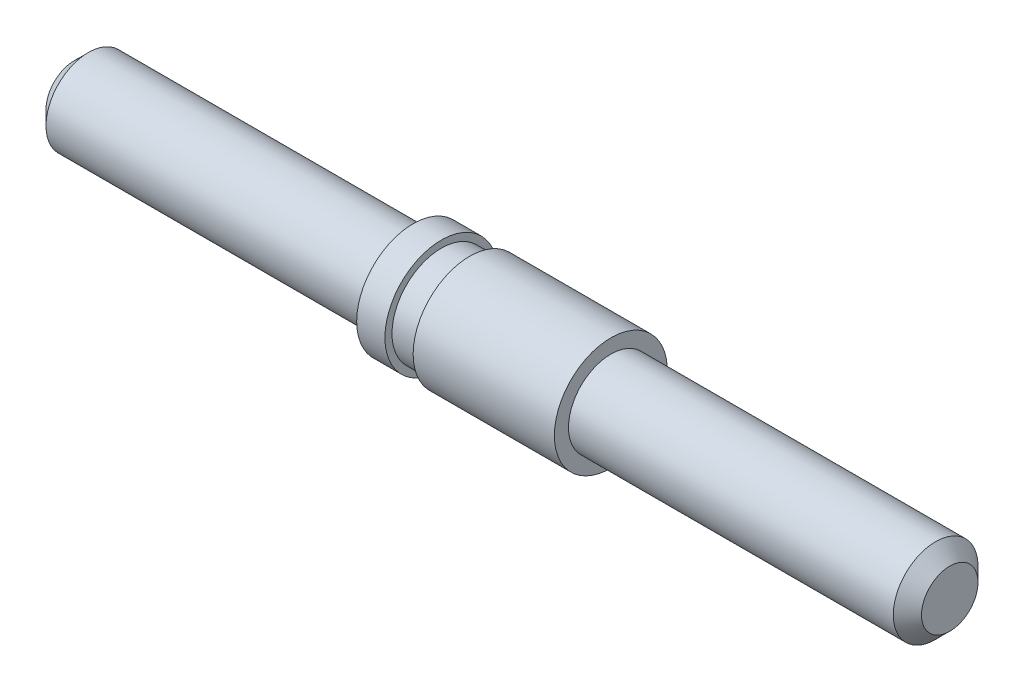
ISO-10303-21;
HEADER;
FILE_DESCRIPTION(('STEP AP214'),'2;1');
FILE_NAME('part.step','',(''),(''),'','','');
FILE_SCHEMA(('AUTOMOTIVE_DESIGN { 1 0 10303 214 1 1 1 1 }'));
ENDSEC;
DATA;
#1=APPLICATION_CONTEXT('core data for automotive mechanical design processes');
#2=APPLICATION_PROTOCOL_DEFINITION('international standard','automotive_design',2000,#1);
#3=PRODUCT_CONTEXT('',#1,'mechanical');
#4=PRODUCT('Part','Part','',(#3));
#5=PRODUCT_RELATED_PRODUCT_CATEGORY('part','',(#4));
#6=PRODUCT_DEFINITION_FORMATION('','',#4);
#7=PRODUCT_DEFINITION_CONTEXT('part definition',#1,'design');
#8=PRODUCT_DEFINITION('design','',#6,#7);
#9=PRODUCT_DEFINITION_SHAPE('','',#8);
#10=(LENGTH_UNIT() NAMED_UNIT(*) SI_UNIT(.MILLI.,.METRE.));
#11=(NAMED_UNIT(*) PLANE_ANGLE_UNIT() SI_UNIT($,.RADIAN.));
#12=(NAMED_UNIT(*) SI_UNIT($,.STERADIAN.) SOLID_ANGLE_UNIT());
#13=UNCERTAINTY_MEASURE_WITH_UNIT(LENGTH_MEASURE(1.E-05),#10,'distance_accuracy_value','');
#14=(GEOMETRIC_REPRESENTATION_CONTEXT(3) GLOBAL_UNCERTAINTY_ASSIGNED_CONTEXT((#13)) GLOBAL_UNIT_ASSIGNED_CONTEXT((#10,
#11,#12)) REPRESENTATION_CONTEXT('',''));
#15=CARTESIAN_POINT('',(0.,0.,0.));
#16=DIRECTION('',(0.,0.,1.));
#17=DIRECTION('',(1.,0.,0.));
#18=AXIS2_PLACEMENT_3D('',#15,#16,#17);
#19=CARTESIAN_POINT('',(25.5,20.,0.));
#20=DIRECTION('',(-1.,0.,0.));
#21=DIRECTION('',(0.,0.,1.));
#22=AXIS2_PLACEMENT_3D('',#19,#20,#21);
#23=CONICAL_SURFACE('',#22,1.49999999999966,0.785398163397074);
#24=CARTESIAN_POINT('',(26.,20.,0.));
#25=DIRECTION('',(-1.,0.,0.));
#26=DIRECTION('',(0.,0.,1.));
#27=AXIS2_PLACEMENT_3D('',#24,#25,#26);
#28=CIRCLE('',#27,1.00000000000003);
#29=CARTESIAN_POINT('',(26.,20.,1.00000000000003));
#30=VERTEX_POINT('',#29);
#31=EDGE_CURVE('E10',#30,#30,#28,.T.);
#32=ORIENTED_EDGE('',*,*,#31,.T.);
#33=EDGE_LOOP('',(#32));
#34=FACE_BOUND('',#33,.T.);
#35=CARTESIAN_POINT('',(25.5,20.,0.));
#36=DIRECTION('',(-1.,0.,0.));
#37=DIRECTION('',(0.,0.,1.));
#38=AXIS2_PLACEMENT_3D('',#35,#36,#37);
#39=CIRCLE('',#38,1.49999999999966);
#40=CARTESIAN_POINT('',(25.5,20.,1.49999999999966));
#41=VERTEX_POINT('',#40);
#42=EDGE_CURVE('E390',#41,#41,#39,.T.);
#43=ORIENTED_EDGE('',*,*,#42,.F.);
#44=EDGE_LOOP('',(#43));
#45=FACE_BOUND('',#44,.T.);
#46=ADVANCED_FACE('F350',(#34,#45),#23,.T.);
#47=CARTESIAN_POINT('',(26.,21.,0.));
#48=DIRECTION('',(1.,0.,0.));
#49=DIRECTION('',(0.,0.,-1.));
#50=AXIS2_PLACEMENT_3D('',#47,#48,#49);
#51=PLANE('',#50);
#52=ORIENTED_EDGE('',*,*,#31,.F.);
#53=EDGE_LOOP('',(#52));
#54=FACE_BOUND('',#53,.T.);
#55=ADVANCED_FACE('F398',(#54),#51,.T.);
#56=CARTESIAN_POINT('',(-5.,20.,0.));
#57=DIRECTION('',(-1.,0.,0.));
#58=DIRECTION('',(0.,0.,1.));
#59=AXIS2_PLACEMENT_3D('',#56,#57,#58);
#60=PLANE('',#59);
#61=CARTESIAN_POINT('',(-5.,20.,0.));
#62=DIRECTION('',(-1.,0.,0.));
#63=DIRECTION('',(0.,0.,1.));
#64=AXIS2_PLACEMENT_3D('',#61,#62,#63);
#65=CIRCLE('',#64,1.00000000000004);
#66=CARTESIAN_POINT('',(-5.,20.,1.00000000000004));
#67=VERTEX_POINT('',#66);
#68=EDGE_CURVE('E356',#67,#67,#65,.T.);
#69=ORIENTED_EDGE('',*,*,#68,.T.);
#70=EDGE_LOOP('',(#69));
#71=FACE_BOUND('',#70,.T.);
#72=ADVANCED_FACE('F402',(#71),#60,.T.);
#73=CARTESIAN_POINT('',(-5.,20.,0.));
#74=DIRECTION('',(1.,0.,0.));
#75=DIRECTION('',(0.,0.,-1.));
#76=AXIS2_PLACEMENT_3D('',#73,#74,#75);
#77=CONICAL_SURFACE('',#76,1.00000000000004,0.785398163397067);
#78=CARTESIAN_POINT('',(-4.5,20.,0.));
#79=DIRECTION('',(-1.,0.,0.));
#80=DIRECTION('',(0.,0.,1.));
#81=AXIS2_PLACEMENT_3D('',#78,#79,#80);
#82=CIRCLE('',#81,1.49999999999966);
#83=CARTESIAN_POINT('',(-4.5,20.,1.49999999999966));
#84=VERTEX_POINT('',#83);
#85=EDGE_CURVE('E360',#84,#84,#82,.T.);
#86=ORIENTED_EDGE('',*,*,#85,.T.);
#87=EDGE_LOOP('',(#86));
#88=FACE_BOUND('',#87,.T.);
#89=ORIENTED_EDGE('',*,*,#68,.F.);
#90=EDGE_LOOP('',(#89));
#91=FACE_BOUND('',#90,.T.);
#92=ADVANCED_FACE('F407',(#88,#91),#77,.T.);
#93=CARTESIAN_POINT('',(26.,20.,0.));
#94=DIRECTION('',(-1.,0.,0.));
#95=DIRECTION('',(0.,0.,1.));
#96=AXIS2_PLACEMENT_3D('',#93,#94,#95);
#97=CYLINDRICAL_SURFACE('',#96,1.49999999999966);
#98=CARTESIAN_POINT('',(7.,20.,0.));
#99=DIRECTION('',(-1.,0.,0.));
#100=DIRECTION('',(0.,0.,1.));
#101=AXIS2_PLACEMENT_3D('',#98,#99,#100);
#102=CIRCLE('',#101,1.49999999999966);
#103=CARTESIAN_POINT('',(7.,20.,1.49999999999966));
#104=VERTEX_POINT('',#103);
#105=EDGE_CURVE('E364',#104,#104,#102,.T.);
#106=ORIENTED_EDGE('',*,*,#105,.T.);
#107=EDGE_LOOP('',(#106));
#108=FACE_BOUND('',#107,.T.);
#109=ORIENTED_EDGE('',*,*,#85,.F.);
#110=EDGE_LOOP('',(#109));
#111=FACE_BOUND('',#110,.T.);
#112=ADVANCED_FACE('F412',(#108,#111),#97,.T.);
#113=CARTESIAN_POINT('',(7.,21.4999999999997,0.));
#114=DIRECTION('',(-1.,0.,0.));
#115=DIRECTION('',(0.,0.,1.));
#116=AXIS2_PLACEMENT_3D('',#113,#114,#115);
#117=PLANE('',#116);
#118=CARTESIAN_POINT('',(7.,20.,0.));
#119=DIRECTION('',(-1.,0.,0.));
#120=DIRECTION('',(0.,0.,1.));
#121=AXIS2_PLACEMENT_3D('',#118,#119,#120);
#122=CIRCLE('',#121,2.00000000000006);
#123=CARTESIAN_POINT('',(7.,20.,2.00000000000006));
#124=VERTEX_POINT('',#123);
#125=EDGE_CURVE('E369',#124,#124,#122,.T.);
#126=ORIENTED_EDGE('',*,*,#125,.T.);
#127=EDGE_LOOP('',(#126));
#128=FACE_BOUND('',#127,.T.);
#129=ORIENTED_EDGE('',*,*,#105,.F.);
#130=EDGE_LOOP('',(#129));
#131=FACE_BOUND('',#130,.T.);
#132=ADVANCED_FACE('F416',(#128,#131),#117,.T.);
#133=CARTESIAN_POINT('',(26.,20.,0.));
#134=DIRECTION('',(-1.,0.,0.));
#135=DIRECTION('',(0.,0.,1.));
#136=AXIS2_PLACEMENT_3D('',#133,#134,#135);
#137=CYLINDRICAL_SURFACE('',#136,2.00000000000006);
#138=CARTESIAN_POINT('',(8.,20.,0.));
#139=DIRECTION('',(-1.,0.,0.));
#140=DIRECTION('',(0.,0.,1.));
#141=AXIS2_PLACEMENT_3D('',#138,#139,#140);
#142=CIRCLE('',#141,2.00000000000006);
#143=CARTESIAN_POINT('',(8.,20.,2.00000000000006));
#144=VERTEX_POINT('',#143);
#145=EDGE_CURVE('E372',#144,#144,#142,.T.);
#146=ORIENTED_EDGE('',*,*,#145,.T.);
#147=EDGE_LOOP('',(#146));
#148=FACE_BOUND('',#147,.T.);
#149=ORIENTED_EDGE('',*,*,#125,.F.);
#150=EDGE_LOOP('',(#149));
#151=FACE_BOUND('',#150,.T.);
#152=ADVANCED_FACE('F420',(#148,#151),#137,.T.);
#153=CARTESIAN_POINT('',(8.,22.0000000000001,0.));
#154=DIRECTION('',(1.,0.,0.));
#155=DIRECTION('',(0.,0.,-1.));
#156=AXIS2_PLACEMENT_3D('',#153,#154,#155);
#157=PLANE('',#156);
#158=CARTESIAN_POINT('',(8.,20.,0.));
#159=DIRECTION('',(-1.,0.,0.));
#160=DIRECTION('',(0.,0.,1.));
#161=AXIS2_PLACEMENT_3D('',#158,#159,#160);
#162=CIRCLE('',#161,1.74999999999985);
#163=CARTESIAN_POINT('',(8.,20.,1.74999999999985));
#164=VERTEX_POINT('',#163);
#165=EDGE_CURVE('E375',#164,#164,#162,.T.);
#166=ORIENTED_EDGE('',*,*,#165,.T.);
#167=EDGE_LOOP('',(#166));
#168=FACE_BOUND('',#167,.T.);
#169=ORIENTED_EDGE('',*,*,#145,.F.);
#170=EDGE_LOOP('',(#169));
#171=FACE_BOUND('',#170,.T.);
#172=ADVANCED_FACE('F424',(#168,#171),#157,.T.);
#173=CARTESIAN_POINT('',(26.,20.,0.));
#174=DIRECTION('',(-1.,0.,0.));
#175=DIRECTION('',(0.,0.,1.));
#176=AXIS2_PLACEMENT_3D('',#173,#174,#175);
#177=CYLINDRICAL_SURFACE('',#176,1.74999999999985);
#178=CARTESIAN_POINT('',(9.,20.,0.));
#179=DIRECTION('',(-1.,0.,0.));
#180=DIRECTION('',(0.,0.,1.));
#181=AXIS2_PLACEMENT_3D('',#178,#179,#180);
#182=CIRCLE('',#181,1.74999999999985);
#183=CARTESIAN_POINT('',(9.,20.,1.74999999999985));
#184=VERTEX_POINT('',#183);
#185=EDGE_CURVE('E378',#184,#184,#182,.T.);
#186=ORIENTED_EDGE('',*,*,#185,.T.);
#187=EDGE_LOOP('',(#186));
#188=FACE_BOUND('',#187,.T.);
#189=ORIENTED_EDGE('',*,*,#165,.F.);
#190=EDGE_LOOP('',(#189));
#191=FACE_BOUND('',#190,.T.);
#192=ADVANCED_FACE('F428',(#188,#191),#177,.T.);
#193=CARTESIAN_POINT('',(9.,21.7499999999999,0.));
#194=DIRECTION('',(-1.,0.,0.));
#195=DIRECTION('',(0.,0.,1.));
#196=AXIS2_PLACEMENT_3D('',#193,#194,#195);
#197=PLANE('',#196);
#198=CARTESIAN_POINT('',(9.,20.,0.));
#199=DIRECTION('',(-1.,0.,0.));
#200=DIRECTION('',(0.,0.,1.));
#201=AXIS2_PLACEMENT_3D('',#198,#199,#200);
#202=CIRCLE('',#201,2.00000000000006);
#203=CARTESIAN_POINT('',(9.,20.,2.00000000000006));
#204=VERTEX_POINT('',#203);
#205=EDGE_CURVE('E381',#204,#204,#202,.T.);
#206=ORIENTED_EDGE('',*,*,#205,.T.);
#207=EDGE_LOOP('',(#206));
#208=FACE_BOUND('',#207,.T.);
#209=ORIENTED_EDGE('',*,*,#185,.F.);
#210=EDGE_LOOP('',(#209));
#211=FACE_BOUND('',#210,.T.);
#212=ADVANCED_FACE('F432',(#208,#211),#197,.T.);
#213=CARTESIAN_POINT('',(26.,20.,0.));
#214=DIRECTION('',(-1.,0.,0.));
#215=DIRECTION('',(0.,0.,1.));
#216=AXIS2_PLACEMENT_3D('',#213,#214,#215);
#217=CYLINDRICAL_SURFACE('',#216,2.00000000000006);
#218=CARTESIAN_POINT('',(14.,20.,0.));
#219=DIRECTION('',(-1.,0.,0.));
#220=DIRECTION('',(0.,0.,1.));
#221=AXIS2_PLACEMENT_3D('',#218,#219,#220);
#222=CIRCLE('',#221,2.00000000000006);
#223=CARTESIAN_POINT('',(14.,20.,2.00000000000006));
#224=VERTEX_POINT('',#223);
#225=EDGE_CURVE('E384',#224,#224,#222,.T.);
#226=ORIENTED_EDGE('',*,*,#225,.T.);
#227=EDGE_LOOP('',(#226));
#228=FACE_BOUND('',#227,.T.);
#229=ORIENTED_EDGE('',*,*,#205,.F.);
#230=EDGE_LOOP('',(#229));
#231=FACE_BOUND('',#230,.T.);
#232=ADVANCED_FACE('F436',(#228,#231),#217,.T.);
#233=CARTESIAN_POINT('',(14.,22.0000000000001,0.));
#234=DIRECTION('',(1.,0.,0.));
#235=DIRECTION('',(0.,0.,-1.));
#236=AXIS2_PLACEMENT_3D('',#233,#234,#235);
#237=PLANE('',#236);
#238=CARTESIAN_POINT('',(14.,20.,0.));
#239=DIRECTION('',(-1.,0.,0.));
#240=DIRECTION('',(0.,0.,1.));
#241=AXIS2_PLACEMENT_3D('',#238,#239,#240);
#242=CIRCLE('',#241,1.49999999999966);
#243=CARTESIAN_POINT('',(14.,20.,1.49999999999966));
#244=VERTEX_POINT('',#243);
#245=EDGE_CURVE('E387',#244,#244,#242,.T.);
#246=ORIENTED_EDGE('',*,*,#245,.T.);
#247=EDGE_LOOP('',(#246));
#248=FACE_BOUND('',#247,.T.);
#249=ORIENTED_EDGE('',*,*,#225,.F.);
#250=EDGE_LOOP('',(#249));
#251=FACE_BOUND('',#250,.T.);
#252=ADVANCED_FACE('F440',(#248,#251),#237,.T.);
#253=CARTESIAN_POINT('',(26.,20.,0.));
#254=DIRECTION('',(-1.,0.,0.));
#255=DIRECTION('',(0.,0.,1.));
#256=AXIS2_PLACEMENT_3D('',#253,#254,#255);
#257=CYLINDRICAL_SURFACE('',#256,1.49999999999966);
#258=ORIENTED_EDGE('',*,*,#42,.T.);
#259=EDGE_LOOP('',(#258));
#260=FACE_BOUND('',#259,.T.);
#261=ORIENTED_EDGE('',*,*,#245,.F.);
#262=EDGE_LOOP('',(#261));
#263=FACE_BOUND('',#262,.T.);
#264=ADVANCED_FACE('F394',(#260,#263),#257,.T.);
#265=CLOSED_SHELL('',(#46,#55,#72,#92,#112,#132,#152,#172,#192,#212,#232,#252,#264));
#266=MANIFOLD_SOLID_BREP('B2',#265);
#267=ADVANCED_BREP_SHAPE_REPRESENTATION('',(#18,#266),#14);
#268=SHAPE_DEFINITION_REPRESENTATION(#9,#267);
ENDSEC;
END-ISO-10303-21;
